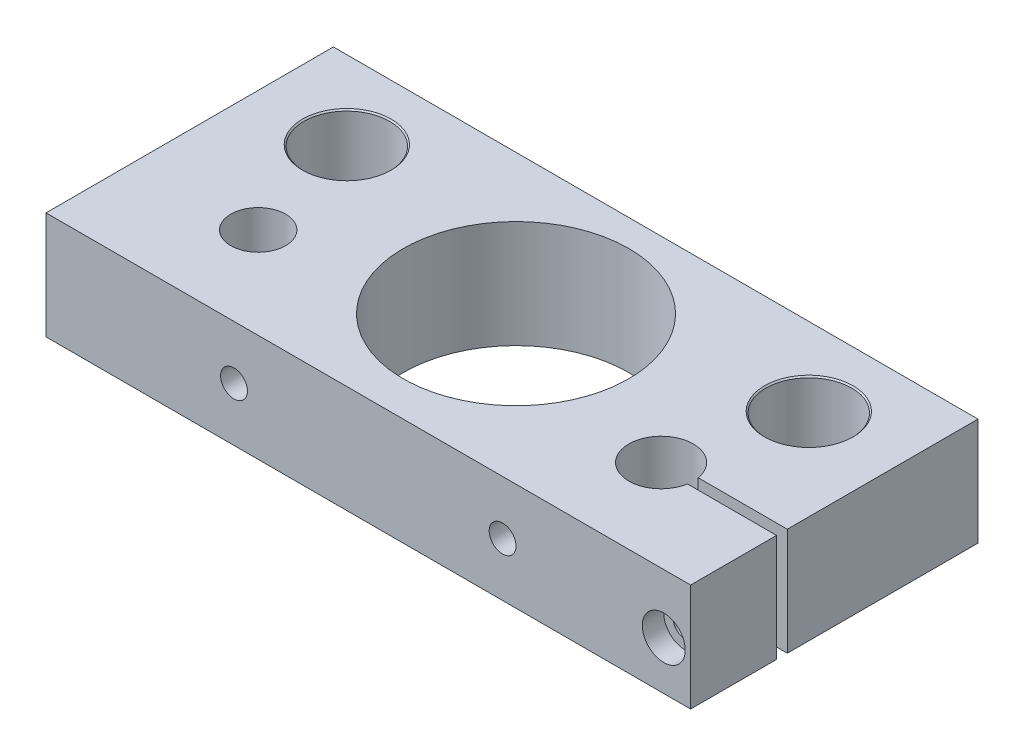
ISO-10303-21;
HEADER;
FILE_DESCRIPTION(('STEP AP214'),'2;1');
FILE_NAME('part.step','',(''),(''),'','','');
FILE_SCHEMA(('AUTOMOTIVE_DESIGN { 1 0 10303 214 1 1 1 1 }'));
ENDSEC;
DATA;
#1=APPLICATION_CONTEXT('core data for automotive mechanical design processes');
#2=APPLICATION_PROTOCOL_DEFINITION('international standard','automotive_design',2000,#1);
#3=PRODUCT_CONTEXT('',#1,'mechanical');
#4=PRODUCT('Part','Part','',(#3));
#5=PRODUCT_RELATED_PRODUCT_CATEGORY('part','',(#4));
#6=PRODUCT_DEFINITION_FORMATION('','',#4);
#7=PRODUCT_DEFINITION_CONTEXT('part definition',#1,'design');
#8=PRODUCT_DEFINITION('design','',#6,#7);
#9=PRODUCT_DEFINITION_SHAPE('','',#8);
#10=(LENGTH_UNIT() NAMED_UNIT(*) SI_UNIT(.MILLI.,.METRE.));
#11=(NAMED_UNIT(*) PLANE_ANGLE_UNIT() SI_UNIT($,.RADIAN.));
#12=(NAMED_UNIT(*) SI_UNIT($,.STERADIAN.) SOLID_ANGLE_UNIT());
#13=UNCERTAINTY_MEASURE_WITH_UNIT(LENGTH_MEASURE(1.E-05),#10,'distance_accuracy_value','');
#14=(GEOMETRIC_REPRESENTATION_CONTEXT(3) GLOBAL_UNCERTAINTY_ASSIGNED_CONTEXT((#13)) GLOBAL_UNIT_ASSIGNED_CONTEXT((#10,
#11,#12)) REPRESENTATION_CONTEXT('',''));
#15=CARTESIAN_POINT('',(0.,0.,0.));
#16=DIRECTION('',(0.,0.,1.));
#17=DIRECTION('',(1.,0.,0.));
#18=AXIS2_PLACEMENT_3D('',#15,#16,#17);
#19=CARTESIAN_POINT('',(120.,20.,0.));
#20=DIRECTION('',(-1.,0.,0.));
#21=DIRECTION('',(0.,0.,1.));
#22=AXIS2_PLACEMENT_3D('',#19,#20,#21);
#23=PLANE('',#22);
#24=DIRECTION('',(0.,0.,-1.));
#25=VECTOR('',#24,1.);
#26=CARTESIAN_POINT('',(120.,0.,0.));
#27=LINE('',#26,#25);
#28=CARTESIAN_POINT('',(120.,0.,0.));
#29=VERTEX_POINT('',#28);
#30=CARTESIAN_POINT('',(120.,0.,-16.));
#31=VERTEX_POINT('',#30);
#32=EDGE_CURVE('E9334',#29,#31,#27,.T.);
#33=ORIENTED_EDGE('',*,*,#32,.T.);
#34=DIRECTION('',(0.,-1.,0.));
#35=VECTOR('',#34,1.);
#36=CARTESIAN_POINT('',(120.,-0.999999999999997,-16.));
#37=LINE('',#36,#35);
#38=CARTESIAN_POINT('',(120.,20.,-16.));
#39=VERTEX_POINT('',#38);
#40=EDGE_CURVE('E9271',#39,#31,#37,.T.);
#41=ORIENTED_EDGE('',*,*,#40,.F.);
#42=DIRECTION('',(0.,0.,-1.));
#43=VECTOR('',#42,1.);
#44=CARTESIAN_POINT('',(120.,20.,0.));
#45=LINE('',#44,#43);
#46=CARTESIAN_POINT('',(120.,20.,0.));
#47=VERTEX_POINT('',#46);
#48=EDGE_CURVE('E9345',#47,#39,#45,.T.);
#49=ORIENTED_EDGE('',*,*,#48,.F.);
#50=DIRECTION('',(0.,-1.,0.));
#51=VECTOR('',#50,1.);
#52=CARTESIAN_POINT('',(120.,20.,0.));
#53=LINE('',#52,#51);
#54=EDGE_CURVE('E9356',#47,#29,#53,.T.);
#55=ORIENTED_EDGE('',*,*,#54,.T.);
#56=EDGE_LOOP('',(#33,#41,#49,#55));
#57=FACE_BOUND('',#56,.T.);
#58=ADVANCED_FACE('F9174',(#57),#23,.F.);
#59=CARTESIAN_POINT('',(0.,20.,0.));
#60=DIRECTION('',(1.,0.,0.));
#61=DIRECTION('',(0.,0.,-1.));
#62=AXIS2_PLACEMENT_3D('',#59,#60,#61);
#63=PLANE('',#62);
#64=DIRECTION('',(0.,0.,1.));
#65=VECTOR('',#64,1.);
#66=CARTESIAN_POINT('',(0.,0.,0.));
#67=LINE('',#66,#65);
#68=CARTESIAN_POINT('',(0.,0.,-53.5));
#69=VERTEX_POINT('',#68);
#70=CARTESIAN_POINT('',(0.,0.,0.));
#71=VERTEX_POINT('',#70);
#72=EDGE_CURVE('E9328',#69,#71,#67,.T.);
#73=ORIENTED_EDGE('',*,*,#72,.T.);
#74=DIRECTION('',(0.,-1.,0.));
#75=VECTOR('',#74,1.);
#76=CARTESIAN_POINT('',(0.,20.,0.));
#77=LINE('',#76,#75);
#78=CARTESIAN_POINT('',(0.,20.,0.));
#79=VERTEX_POINT('',#78);
#80=EDGE_CURVE('E9359',#79,#71,#77,.T.);
#81=ORIENTED_EDGE('',*,*,#80,.F.);
#82=DIRECTION('',(0.,0.,1.));
#83=VECTOR('',#82,1.);
#84=CARTESIAN_POINT('',(0.,20.,0.));
#85=LINE('',#84,#83);
#86=CARTESIAN_POINT('',(0.,20.,-53.5));
#87=VERTEX_POINT('',#86);
#88=EDGE_CURVE('E9339',#87,#79,#85,.T.);
#89=ORIENTED_EDGE('',*,*,#88,.F.);
#90=DIRECTION('',(0.,-1.,0.));
#91=VECTOR('',#90,1.);
#92=CARTESIAN_POINT('',(0.,20.,-53.5));
#93=LINE('',#92,#91);
#94=EDGE_CURVE('E9350',#87,#69,#93,.T.);
#95=ORIENTED_EDGE('',*,*,#94,.T.);
#96=EDGE_LOOP('',(#73,#81,#89,#95));
#97=FACE_BOUND('',#96,.T.);
#98=ADVANCED_FACE('F9176',(#97),#63,.F.);
#99=CARTESIAN_POINT('',(0.,20.,0.));
#100=DIRECTION('',(0.,0.,-1.));
#101=DIRECTION('',(-1.,0.,0.));
#102=AXIS2_PLACEMENT_3D('',#99,#100,#101);
#103=PLANE('',#102);
#104=CARTESIAN_POINT('',(115.,9.,0.));
#105=DIRECTION('',(0.,0.,1.));
#106=DIRECTION('',(1.,0.,0.));
#107=AXIS2_PLACEMENT_3D('',#104,#105,#106);
#108=CIRCLE('',#107,4.);
#109=CARTESIAN_POINT('',(119.,9.,0.));
#110=VERTEX_POINT('',#109);
#111=EDGE_CURVE('E9266',#110,#110,#108,.T.);
#112=ORIENTED_EDGE('',*,*,#111,.F.);
#113=EDGE_LOOP('',(#112));
#114=FACE_BOUND('',#113,.T.);
#115=CARTESIAN_POINT('',(85.,10.,0.));
#116=DIRECTION('',(0.,0.,1.));
#117=DIRECTION('',(1.,0.,0.));
#118=AXIS2_PLACEMENT_3D('',#115,#116,#117);
#119=CIRCLE('',#118,2.49999999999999);
#120=CARTESIAN_POINT('',(87.5,10.,0.));
#121=VERTEX_POINT('',#120);
#122=EDGE_CURVE('E9295',#121,#121,#119,.T.);
#123=ORIENTED_EDGE('',*,*,#122,.F.);
#124=EDGE_LOOP('',(#123));
#125=FACE_BOUND('',#124,.T.);
#126=CARTESIAN_POINT('',(35.,10.,0.));
#127=DIRECTION('',(0.,0.,1.));
#128=DIRECTION('',(1.,0.,0.));
#129=AXIS2_PLACEMENT_3D('',#126,#127,#128);
#130=CIRCLE('',#129,2.49999999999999);
#131=CARTESIAN_POINT('',(37.5,10.,0.));
#132=VERTEX_POINT('',#131);
#133=EDGE_CURVE('E9301',#132,#132,#130,.T.);
#134=ORIENTED_EDGE('',*,*,#133,.F.);
#135=EDGE_LOOP('',(#134));
#136=FACE_BOUND('',#135,.T.);
#137=DIRECTION('',(1.,0.,0.));
#138=VECTOR('',#137,1.);
#139=CARTESIAN_POINT('',(0.,0.,0.));
#140=LINE('',#139,#138);
#141=EDGE_CURVE('E9331',#71,#29,#140,.T.);
#142=ORIENTED_EDGE('',*,*,#141,.T.);
#143=ORIENTED_EDGE('',*,*,#54,.F.);
#144=DIRECTION('',(1.,0.,0.));
#145=VECTOR('',#144,1.);
#146=CARTESIAN_POINT('',(0.,20.,0.));
#147=LINE('',#146,#145);
#148=EDGE_CURVE('E9342',#79,#47,#147,.T.);
#149=ORIENTED_EDGE('',*,*,#148,.F.);
#150=ORIENTED_EDGE('',*,*,#80,.T.);
#151=EDGE_LOOP('',(#142,#143,#149,#150));
#152=FACE_BOUND('',#151,.T.);
#153=ADVANCED_FACE('F9396',(#114,#125,#136,#152),#103,.F.);
#154=CARTESIAN_POINT('',(120.,20.,-18.));
#155=VERTEX_POINT('',#154);
#156=CARTESIAN_POINT('',(120.,20.,-53.5));
#157=VERTEX_POINT('',#156);
#158=EDGE_CURVE('E9344',#155,#157,#45,.T.);
#159=ORIENTED_EDGE('',*,*,#158,.F.);
#160=DIRECTION('',(0.,1.,0.));
#161=VECTOR('',#160,1.);
#162=CARTESIAN_POINT('',(120.,-0.999999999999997,-18.));
#163=LINE('',#162,#161);
#164=CARTESIAN_POINT('',(120.,0.,-18.));
#165=VERTEX_POINT('',#164);
#166=EDGE_CURVE('E9269',#165,#155,#163,.T.);
#167=ORIENTED_EDGE('',*,*,#166,.F.);
#168=CARTESIAN_POINT('',(120.,0.,-53.5));
#169=VERTEX_POINT('',#168);
#170=EDGE_CURVE('E9333',#165,#169,#27,.T.);
#171=ORIENTED_EDGE('',*,*,#170,.T.);
#172=DIRECTION('',(0.,-1.,0.));
#173=VECTOR('',#172,1.);
#174=CARTESIAN_POINT('',(120.,20.,-53.5));
#175=LINE('',#174,#173);
#176=EDGE_CURVE('E9353',#157,#169,#175,.T.);
#177=ORIENTED_EDGE('',*,*,#176,.F.);
#178=EDGE_LOOP('',(#159,#167,#171,#177));
#179=FACE_BOUND('',#178,.T.);
#180=ADVANCED_FACE('F9386',(#179),#23,.F.);
#181=CARTESIAN_POINT('',(0.,20.,-53.5));
#182=DIRECTION('',(0.,0.,1.));
#183=DIRECTION('',(1.,0.,0.));
#184=AXIS2_PLACEMENT_3D('',#181,#182,#183);
#185=PLANE('',#184);
#186=CARTESIAN_POINT('',(85.,10.,-53.5));
#187=DIRECTION('',(0.,0.,1.));
#188=DIRECTION('',(1.,0.,0.));
#189=AXIS2_PLACEMENT_3D('',#186,#187,#188);
#190=CIRCLE('',#189,2.49999999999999);
#191=CARTESIAN_POINT('',(87.5,10.,-53.5));
#192=VERTEX_POINT('',#191);
#193=EDGE_CURVE('E9292',#192,#192,#190,.T.);
#194=ORIENTED_EDGE('',*,*,#193,.T.);
#195=EDGE_LOOP('',(#194));
#196=FACE_BOUND('',#195,.T.);
#197=CARTESIAN_POINT('',(35.,10.,-53.5));
#198=DIRECTION('',(0.,0.,1.));
#199=DIRECTION('',(1.,0.,0.));
#200=AXIS2_PLACEMENT_3D('',#197,#198,#199);
#201=CIRCLE('',#200,2.49999999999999);
#202=CARTESIAN_POINT('',(37.5,10.,-53.5));
#203=VERTEX_POINT('',#202);
#204=EDGE_CURVE('E9298',#203,#203,#201,.T.);
#205=ORIENTED_EDGE('',*,*,#204,.T.);
#206=EDGE_LOOP('',(#205));
#207=FACE_BOUND('',#206,.T.);
#208=DIRECTION('',(-1.,0.,0.));
#209=VECTOR('',#208,1.);
#210=CARTESIAN_POINT('',(0.,0.,-53.5));
#211=LINE('',#210,#209);
#212=EDGE_CURVE('E9337',#169,#69,#211,.T.);
#213=ORIENTED_EDGE('',*,*,#212,.T.);
#214=ORIENTED_EDGE('',*,*,#94,.F.);
#215=DIRECTION('',(-1.,0.,0.));
#216=VECTOR('',#215,1.);
#217=CARTESIAN_POINT('',(0.,20.,-53.5));
#218=LINE('',#217,#216);
#219=EDGE_CURVE('E9348',#157,#87,#218,.T.);
#220=ORIENTED_EDGE('',*,*,#219,.F.);
#221=ORIENTED_EDGE('',*,*,#176,.T.);
#222=EDGE_LOOP('',(#213,#214,#220,#221));
#223=FACE_BOUND('',#222,.T.);
#224=ADVANCED_FACE('F9393',(#196,#207,#223),#185,.F.);
#225=CARTESIAN_POINT('',(0.,20.,-53.5));
#226=DIRECTION('',(0.,-1.,0.));
#227=DIRECTION('',(0.,0.,-1.));
#228=AXIS2_PLACEMENT_3D('',#225,#226,#227);
#229=PLANE('',#228);
#230=CARTESIAN_POINT('',(60.,20.,-27.5));
#231=DIRECTION('',(0.,-1.,0.));
#232=DIRECTION('',(0.,0.,-1.));
#233=AXIS2_PLACEMENT_3D('',#230,#231,#232);
#234=CIRCLE('',#233,21.);
#235=CARTESIAN_POINT('',(60.,20.,-48.5));
#236=VERTEX_POINT('',#235);
#237=EDGE_CURVE('E9251',#236,#236,#234,.T.);
#238=ORIENTED_EDGE('',*,*,#237,.T.);
#239=EDGE_LOOP('',(#238));
#240=FACE_BOUND('',#239,.T.);
#241=CARTESIAN_POINT('',(22.5,20.,-17.));
#242=DIRECTION('',(0.,-1.,0.));
#243=DIRECTION('',(0.,0.,-1.));
#244=AXIS2_PLACEMENT_3D('',#241,#242,#243);
#245=CIRCLE('',#244,5.1);
#246=CARTESIAN_POINT('',(22.5,20.,-22.1));
#247=VERTEX_POINT('',#246);
#248=EDGE_CURVE('E9280',#247,#247,#245,.T.);
#249=ORIENTED_EDGE('',*,*,#248,.T.);
#250=EDGE_LOOP('',(#249));
#251=FACE_BOUND('',#250,.T.);
#252=ORIENTED_EDGE('',*,*,#48,.T.);
#253=DIRECTION('',(-1.,0.,0.));
#254=VECTOR('',#253,1.);
#255=CARTESIAN_POINT('',(0.,20.,-16.));
#256=LINE('',#255,#254);
#257=CARTESIAN_POINT('',(103.4160797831,20.,-16.));
#258=VERTEX_POINT('',#257);
#259=EDGE_CURVE('E9277',#39,#258,#256,.T.);
#260=ORIENTED_EDGE('',*,*,#259,.T.);
#261=CARTESIAN_POINT('',(97.5,20.,-17.));
#262=DIRECTION('',(0.,-1.,0.));
#263=DIRECTION('',(0.,0.,-1.));
#264=AXIS2_PLACEMENT_3D('',#261,#262,#263);
#265=CIRCLE('',#264,5.99999999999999);
#266=CARTESIAN_POINT('',(103.4160797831,20.,-18.));
#267=VERTEX_POINT('',#266);
#268=EDGE_CURVE('E9286',#258,#267,#265,.T.);
#269=ORIENTED_EDGE('',*,*,#268,.T.);
#270=DIRECTION('',(1.,0.,0.));
#271=VECTOR('',#270,1.);
#272=CARTESIAN_POINT('',(0.,20.,-18.));
#273=LINE('',#272,#271);
#274=EDGE_CURVE('E9197',#267,#155,#273,.T.);
#275=ORIENTED_EDGE('',*,*,#274,.T.);
#276=ORIENTED_EDGE('',*,*,#158,.T.);
#277=ORIENTED_EDGE('',*,*,#219,.T.);
#278=ORIENTED_EDGE('',*,*,#88,.T.);
#279=ORIENTED_EDGE('',*,*,#148,.T.);
#280=EDGE_LOOP('',(#252,#260,#269,#275,#276,#277,#278,#279));
#281=FACE_BOUND('',#280,.T.);
#282=CARTESIAN_POINT('',(103.,20.,-39.));
#283=DIRECTION('',(0.,-1.,0.));
#284=DIRECTION('',(0.,0.,-1.));
#285=AXIS2_PLACEMENT_3D('',#282,#283,#284);
#286=CIRCLE('',#285,8.24999999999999);
#287=CARTESIAN_POINT('',(103.,20.,-47.25));
#288=VERTEX_POINT('',#287);
#289=EDGE_CURVE('E9304',#288,#288,#286,.T.);
#290=ORIENTED_EDGE('',*,*,#289,.T.);
#291=EDGE_LOOP('',(#290));
#292=FACE_BOUND('',#291,.T.);
#293=CARTESIAN_POINT('',(17.,20.,-39.));
#294=DIRECTION('',(0.,-1.,0.));
#295=DIRECTION('',(0.,0.,-1.));
#296=AXIS2_PLACEMENT_3D('',#293,#294,#295);
#297=CIRCLE('',#296,8.24999999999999);
#298=CARTESIAN_POINT('',(17.,20.,-47.25));
#299=VERTEX_POINT('',#298);
#300=EDGE_CURVE('E9316',#299,#299,#297,.T.);
#301=ORIENTED_EDGE('',*,*,#300,.T.);
#302=EDGE_LOOP('',(#301));
#303=FACE_BOUND('',#302,.T.);
#304=ADVANCED_FACE('F9368',(#240,#251,#281,#292,#303),#229,.F.);
#305=CARTESIAN_POINT('',(0.,0.,-53.5));
#306=DIRECTION('',(0.,-1.,0.));
#307=DIRECTION('',(0.,0.,-1.));
#308=AXIS2_PLACEMENT_3D('',#305,#306,#307);
#309=PLANE('',#308);
#310=CARTESIAN_POINT('',(60.,0.,-27.5));
#311=DIRECTION('',(0.,-1.,0.));
#312=DIRECTION('',(0.,0.,-1.));
#313=AXIS2_PLACEMENT_3D('',#310,#311,#312);
#314=CIRCLE('',#313,21.);
#315=CARTESIAN_POINT('',(60.,0.,-48.5));
#316=VERTEX_POINT('',#315);
#317=EDGE_CURVE('E9257',#316,#316,#314,.T.);
#318=ORIENTED_EDGE('',*,*,#317,.F.);
#319=EDGE_LOOP('',(#318));
#320=FACE_BOUND('',#319,.T.);
#321=DIRECTION('',(-1.,0.,0.));
#322=VECTOR('',#321,1.);
#323=CARTESIAN_POINT('',(0.,0.,-16.));
#324=LINE('',#323,#322);
#325=CARTESIAN_POINT('',(103.4160797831,0.,-16.));
#326=VERTEX_POINT('',#325);
#327=EDGE_CURVE('E9190',#31,#326,#324,.T.);
#328=ORIENTED_EDGE('',*,*,#327,.F.);
#329=ORIENTED_EDGE('',*,*,#32,.F.);
#330=ORIENTED_EDGE('',*,*,#141,.F.);
#331=ORIENTED_EDGE('',*,*,#72,.F.);
#332=ORIENTED_EDGE('',*,*,#212,.F.);
#333=ORIENTED_EDGE('',*,*,#170,.F.);
#334=DIRECTION('',(1.,0.,0.));
#335=VECTOR('',#334,1.);
#336=CARTESIAN_POINT('',(0.,0.,-18.));
#337=LINE('',#336,#335);
#338=CARTESIAN_POINT('',(103.4160797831,0.,-18.));
#339=VERTEX_POINT('',#338);
#340=EDGE_CURVE('E9273',#339,#165,#337,.T.);
#341=ORIENTED_EDGE('',*,*,#340,.F.);
#342=CARTESIAN_POINT('',(97.5,0.,-17.));
#343=DIRECTION('',(0.,-1.,0.));
#344=DIRECTION('',(0.,0.,-1.));
#345=AXIS2_PLACEMENT_3D('',#342,#343,#344);
#346=CIRCLE('',#345,5.99999999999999);
#347=EDGE_CURVE('E9289',#326,#339,#346,.T.);
#348=ORIENTED_EDGE('',*,*,#347,.F.);
#349=EDGE_LOOP('',(#328,#329,#330,#331,#332,#333,#341,#348));
#350=FACE_BOUND('',#349,.T.);
#351=CARTESIAN_POINT('',(22.5,0.,-17.));
#352=DIRECTION('',(0.,-1.,0.));
#353=DIRECTION('',(0.,0.,-1.));
#354=AXIS2_PLACEMENT_3D('',#351,#352,#353);
#355=CIRCLE('',#354,5.09999999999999);
#356=CARTESIAN_POINT('',(22.5,0.,-22.1));
#357=VERTEX_POINT('',#356);
#358=EDGE_CURVE('E9283',#357,#357,#355,.T.);
#359=ORIENTED_EDGE('',*,*,#358,.F.);
#360=EDGE_LOOP('',(#359));
#361=FACE_BOUND('',#360,.T.);
#362=CARTESIAN_POINT('',(103.,0.,-39.));
#363=DIRECTION('',(0.,-1.,0.));
#364=DIRECTION('',(0.,0.,-1.));
#365=AXIS2_PLACEMENT_3D('',#362,#363,#364);
#366=CIRCLE('',#365,8.25000000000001);
#367=CARTESIAN_POINT('',(103.,0.,-47.25));
#368=VERTEX_POINT('',#367);
#369=EDGE_CURVE('E9313',#368,#368,#366,.T.);
#370=ORIENTED_EDGE('',*,*,#369,.F.);
#371=EDGE_LOOP('',(#370));
#372=FACE_BOUND('',#371,.T.);
#373=CARTESIAN_POINT('',(17.,0.,-39.));
#374=DIRECTION('',(0.,-1.,0.));
#375=DIRECTION('',(0.,0.,-1.));
#376=AXIS2_PLACEMENT_3D('',#373,#374,#375);
#377=CIRCLE('',#376,8.25);
#378=CARTESIAN_POINT('',(17.,0.,-47.25));
#379=VERTEX_POINT('',#378);
#380=EDGE_CURVE('E9325',#379,#379,#377,.T.);
#381=ORIENTED_EDGE('',*,*,#380,.F.);
#382=EDGE_LOOP('',(#381));
#383=FACE_BOUND('',#382,.T.);
#384=ADVANCED_FACE('F9378',(#320,#350,#361,#372,#383),#309,.T.);
#385=CARTESIAN_POINT('',(17.,0.,-39.));
#386=DIRECTION('',(0.,-1.,0.));
#387=DIRECTION('',(0.,0.,-1.));
#388=AXIS2_PLACEMENT_3D('',#385,#386,#387);
#389=CONICAL_SURFACE('',#388,8.25,0.785398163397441);
#390=CARTESIAN_POINT('',(17.,0.250000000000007,-39.));
#391=DIRECTION('',(0.,-1.,0.));
#392=DIRECTION('',(0.,0.,-1.));
#393=AXIS2_PLACEMENT_3D('',#390,#391,#392);
#394=CIRCLE('',#393,8.);
#395=CARTESIAN_POINT('',(17.,0.250000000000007,-47.));
#396=VERTEX_POINT('',#395);
#397=EDGE_CURVE('E9322',#396,#396,#394,.T.);
#398=ORIENTED_EDGE('',*,*,#397,.F.);
#399=EDGE_LOOP('',(#398));
#400=FACE_BOUND('',#399,.T.);
#401=ORIENTED_EDGE('',*,*,#380,.T.);
#402=EDGE_LOOP('',(#401));
#403=FACE_BOUND('',#402,.T.);
#404=ADVANCED_FACE('F9421',(#400,#403),#389,.F.);
#405=CARTESIAN_POINT('',(17.,0.,-39.));
#406=DIRECTION('',(0.,-1.,0.));
#407=DIRECTION('',(0.,0.,-1.));
#408=AXIS2_PLACEMENT_3D('',#405,#406,#407);
#409=CYLINDRICAL_SURFACE('',#408,7.99999999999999);
#410=CARTESIAN_POINT('',(17.,19.75,-39.));
#411=DIRECTION('',(0.,-1.,0.));
#412=DIRECTION('',(0.,0.,-1.));
#413=AXIS2_PLACEMENT_3D('',#410,#411,#412);
#414=CIRCLE('',#413,7.99999999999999);
#415=CARTESIAN_POINT('',(17.,19.75,-47.));
#416=VERTEX_POINT('',#415);
#417=EDGE_CURVE('E9319',#416,#416,#414,.T.);
#418=ORIENTED_EDGE('',*,*,#417,.F.);
#419=EDGE_LOOP('',(#418));
#420=FACE_BOUND('',#419,.T.);
#421=ORIENTED_EDGE('',*,*,#397,.T.);
#422=EDGE_LOOP('',(#421));
#423=FACE_BOUND('',#422,.T.);
#424=ADVANCED_FACE('F9425',(#420,#423),#409,.F.);
#425=CARTESIAN_POINT('',(17.,19.75,-39.));
#426=DIRECTION('',(0.,1.,0.));
#427=DIRECTION('',(0.,0.,1.));
#428=AXIS2_PLACEMENT_3D('',#425,#426,#427);
#429=CONICAL_SURFACE('',#428,7.99999999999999,0.785398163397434);
#430=ORIENTED_EDGE('',*,*,#300,.F.);
#431=EDGE_LOOP('',(#430));
#432=FACE_BOUND('',#431,.T.);
#433=ORIENTED_EDGE('',*,*,#417,.T.);
#434=EDGE_LOOP('',(#433));
#435=FACE_BOUND('',#434,.T.);
#436=ADVANCED_FACE('F9429',(#432,#435),#429,.F.);
#437=CARTESIAN_POINT('',(103.,0.,-39.));
#438=DIRECTION('',(0.,-1.,0.));
#439=DIRECTION('',(0.,0.,-1.));
#440=AXIS2_PLACEMENT_3D('',#437,#438,#439);
#441=CONICAL_SURFACE('',#440,8.25000000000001,0.785398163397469);
#442=CARTESIAN_POINT('',(103.,0.250000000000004,-39.));
#443=DIRECTION('',(0.,-1.,0.));
#444=DIRECTION('',(0.,0.,-1.));
#445=AXIS2_PLACEMENT_3D('',#442,#443,#444);
#446=CIRCLE('',#445,7.99999999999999);
#447=CARTESIAN_POINT('',(103.,0.250000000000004,-47.));
#448=VERTEX_POINT('',#447);
#449=EDGE_CURVE('E9310',#448,#448,#446,.T.);
#450=ORIENTED_EDGE('',*,*,#449,.F.);
#451=EDGE_LOOP('',(#450));
#452=FACE_BOUND('',#451,.T.);
#453=ORIENTED_EDGE('',*,*,#369,.T.);
#454=EDGE_LOOP('',(#453));
#455=FACE_BOUND('',#454,.T.);
#456=ADVANCED_FACE('F9433',(#452,#455),#441,.F.);
#457=CARTESIAN_POINT('',(103.,0.,-39.));
#458=DIRECTION('',(0.,-1.,0.));
#459=DIRECTION('',(0.,0.,-1.));
#460=AXIS2_PLACEMENT_3D('',#457,#458,#459);
#461=CYLINDRICAL_SURFACE('',#460,7.99999999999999);
#462=CARTESIAN_POINT('',(103.,19.75,-39.));
#463=DIRECTION('',(0.,-1.,0.));
#464=DIRECTION('',(0.,0.,-1.));
#465=AXIS2_PLACEMENT_3D('',#462,#463,#464);
#466=CIRCLE('',#465,7.99999999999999);
#467=CARTESIAN_POINT('',(103.,19.75,-47.));
#468=VERTEX_POINT('',#467);
#469=EDGE_CURVE('E9307',#468,#468,#466,.T.);
#470=ORIENTED_EDGE('',*,*,#469,.F.);
#471=EDGE_LOOP('',(#470));
#472=FACE_BOUND('',#471,.T.);
#473=ORIENTED_EDGE('',*,*,#449,.T.);
#474=EDGE_LOOP('',(#473));
#475=FACE_BOUND('',#474,.T.);
#476=ADVANCED_FACE('F9437',(#472,#475),#461,.F.);
#477=CARTESIAN_POINT('',(103.,19.75,-39.));
#478=DIRECTION('',(0.,1.,0.));
#479=DIRECTION('',(0.,0.,1.));
#480=AXIS2_PLACEMENT_3D('',#477,#478,#479);
#481=CONICAL_SURFACE('',#480,7.99999999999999,0.785398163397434);
#482=ORIENTED_EDGE('',*,*,#289,.F.);
#483=EDGE_LOOP('',(#482));
#484=FACE_BOUND('',#483,.T.);
#485=ORIENTED_EDGE('',*,*,#469,.T.);
#486=EDGE_LOOP('',(#485));
#487=FACE_BOUND('',#486,.T.);
#488=ADVANCED_FACE('F9441',(#484,#487),#481,.F.);
#489=CARTESIAN_POINT('',(35.,10.,0.));
#490=DIRECTION('',(0.,0.,1.));
#491=DIRECTION('',(1.,0.,0.));
#492=AXIS2_PLACEMENT_3D('',#489,#490,#491);
#493=CYLINDRICAL_SURFACE('',#492,2.49999999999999);
#494=ORIENTED_EDGE('',*,*,#204,.F.);
#495=EDGE_LOOP('',(#494));
#496=FACE_BOUND('',#495,.T.);
#497=ORIENTED_EDGE('',*,*,#133,.T.);
#498=EDGE_LOOP('',(#497));
#499=FACE_BOUND('',#498,.T.);
#500=ADVANCED_FACE('F9445',(#496,#499),#493,.F.);
#501=CARTESIAN_POINT('',(85.,10.,0.));
#502=DIRECTION('',(0.,0.,1.));
#503=DIRECTION('',(1.,0.,0.));
#504=AXIS2_PLACEMENT_3D('',#501,#502,#503);
#505=CYLINDRICAL_SURFACE('',#504,2.49999999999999);
#506=ORIENTED_EDGE('',*,*,#193,.F.);
#507=EDGE_LOOP('',(#506));
#508=FACE_BOUND('',#507,.T.);
#509=ORIENTED_EDGE('',*,*,#122,.T.);
#510=EDGE_LOOP('',(#509));
#511=FACE_BOUND('',#510,.T.);
#512=ADVANCED_FACE('F9449',(#508,#511),#505,.F.);
#513=CARTESIAN_POINT('',(97.5,0.,-17.));
#514=DIRECTION('',(0.,-1.,0.));
#515=DIRECTION('',(0.,0.,-1.));
#516=AXIS2_PLACEMENT_3D('',#513,#514,#515);
#517=CYLINDRICAL_SURFACE('',#516,5.99999999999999);
#518=ORIENTED_EDGE('',*,*,#268,.F.);
#519=DIRECTION('',(0.,-1.,0.));
#520=VECTOR('',#519,1.);
#521=CARTESIAN_POINT('',(103.4160797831,0.,-16.));
#522=LINE('',#521,#520);
#523=EDGE_CURVE('E11',#258,#326,#522,.T.);
#524=ORIENTED_EDGE('',*,*,#523,.T.);
#525=ORIENTED_EDGE('',*,*,#347,.T.);
#526=DIRECTION('',(0.,-1.,0.));
#527=VECTOR('',#526,1.);
#528=CARTESIAN_POINT('',(103.4160797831,0.,-18.));
#529=LINE('',#528,#527);
#530=EDGE_CURVE('E9183',#339,#267,#529,.F.);
#531=ORIENTED_EDGE('',*,*,#530,.T.);
#532=EDGE_LOOP('',(#518,#524,#525,#531));
#533=FACE_BOUND('',#532,.T.);
#534=ADVANCED_FACE('F9364',(#533),#517,.F.);
#535=CARTESIAN_POINT('',(22.5,0.,-17.));
#536=DIRECTION('',(0.,-1.,0.));
#537=DIRECTION('',(0.,0.,-1.));
#538=AXIS2_PLACEMENT_3D('',#535,#536,#537);
#539=CYLINDRICAL_SURFACE('',#538,5.09999999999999);
#540=ORIENTED_EDGE('',*,*,#248,.F.);
#541=EDGE_LOOP('',(#540));
#542=FACE_BOUND('',#541,.T.);
#543=ORIENTED_EDGE('',*,*,#358,.T.);
#544=EDGE_LOOP('',(#543));
#545=FACE_BOUND('',#544,.T.);
#546=ADVANCED_FACE('F9455',(#542,#545),#539,.F.);
#547=CARTESIAN_POINT('',(97.5,-0.999999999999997,-18.));
#548=DIRECTION('',(0.,0.,-1.));
#549=DIRECTION('',(0.,1.,0.));
#550=AXIS2_PLACEMENT_3D('',#547,#548,#549);
#551=PLANE('',#550);
#552=CARTESIAN_POINT('',(115.,9.,-18.));
#553=DIRECTION('',(0.,0.,1.));
#554=DIRECTION('',(1.,0.,0.));
#555=AXIS2_PLACEMENT_3D('',#552,#553,#554);
#556=CIRCLE('',#555,1.64999999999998);
#557=CARTESIAN_POINT('',(116.65,9.,-18.));
#558=VERTEX_POINT('',#557);
#559=EDGE_CURVE('E9250',#558,#558,#556,.T.);
#560=ORIENTED_EDGE('',*,*,#559,.F.);
#561=EDGE_LOOP('',(#560));
#562=FACE_BOUND('',#561,.T.);
#563=ORIENTED_EDGE('',*,*,#530,.F.);
#564=ORIENTED_EDGE('',*,*,#340,.T.);
#565=ORIENTED_EDGE('',*,*,#166,.T.);
#566=ORIENTED_EDGE('',*,*,#274,.F.);
#567=EDGE_LOOP('',(#563,#564,#565,#566));
#568=FACE_BOUND('',#567,.T.);
#569=ADVANCED_FACE('F9384',(#562,#568),#551,.F.);
#570=CARTESIAN_POINT('',(97.5,-0.999999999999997,-16.));
#571=DIRECTION('',(0.,0.,1.));
#572=DIRECTION('',(0.,-1.,0.));
#573=AXIS2_PLACEMENT_3D('',#570,#571,#572);
#574=PLANE('',#573);
#575=CARTESIAN_POINT('',(115.,9.,-16.));
#576=DIRECTION('',(0.,0.,1.));
#577=DIRECTION('',(0.,-1.,0.));
#578=AXIS2_PLACEMENT_3D('',#575,#576,#577);
#579=CIRCLE('',#578,2.25);
#580=CARTESIAN_POINT('',(115.,6.75,-16.));
#581=VERTEX_POINT('',#580);
#582=EDGE_CURVE('E9178',#581,#581,#579,.T.);
#583=ORIENTED_EDGE('',*,*,#582,.T.);
#584=EDGE_LOOP('',(#583));
#585=FACE_BOUND('',#584,.T.);
#586=ORIENTED_EDGE('',*,*,#40,.T.);
#587=ORIENTED_EDGE('',*,*,#327,.T.);
#588=ORIENTED_EDGE('',*,*,#523,.F.);
#589=ORIENTED_EDGE('',*,*,#259,.F.);
#590=EDGE_LOOP('',(#586,#587,#588,#589));
#591=FACE_BOUND('',#590,.T.);
#592=ADVANCED_FACE('F9373',(#585,#591),#574,.F.);
#593=CARTESIAN_POINT('',(115.,9.,0.));
#594=DIRECTION('',(0.,0.,1.));
#595=DIRECTION('',(1.,0.,0.));
#596=AXIS2_PLACEMENT_3D('',#593,#594,#595);
#597=CYLINDRICAL_SURFACE('',#596,2.25);
#598=CARTESIAN_POINT('',(115.,9.,-4.));
#599=DIRECTION('',(0.,0.,1.));
#600=DIRECTION('',(1.,0.,0.));
#601=AXIS2_PLACEMENT_3D('',#598,#599,#600);
#602=CIRCLE('',#601,2.25);
#603=CARTESIAN_POINT('',(117.25,9.,-4.));
#604=VERTEX_POINT('',#603);
#605=EDGE_CURVE('E9254',#604,#604,#602,.T.);
#606=ORIENTED_EDGE('',*,*,#605,.T.);
#607=EDGE_LOOP('',(#606));
#608=FACE_BOUND('',#607,.T.);
#609=ORIENTED_EDGE('',*,*,#582,.F.);
#610=EDGE_LOOP('',(#609));
#611=FACE_BOUND('',#610,.T.);
#612=ADVANCED_FACE('F9462',(#608,#611),#597,.F.);
#613=CARTESIAN_POINT('',(115.,9.,0.));
#614=DIRECTION('',(0.,0.,1.));
#615=DIRECTION('',(1.,0.,0.));
#616=AXIS2_PLACEMENT_3D('',#613,#614,#615);
#617=CYLINDRICAL_SURFACE('',#616,4.);
#618=CARTESIAN_POINT('',(115.,9.,-4.));
#619=DIRECTION('',(0.,0.,1.));
#620=DIRECTION('',(1.,0.,0.));
#621=AXIS2_PLACEMENT_3D('',#618,#619,#620);
#622=CIRCLE('',#621,4.);
#623=CARTESIAN_POINT('',(119.,9.,-4.));
#624=VERTEX_POINT('',#623);
#625=EDGE_CURVE('E9263',#624,#624,#622,.T.);
#626=ORIENTED_EDGE('',*,*,#625,.F.);
#627=EDGE_LOOP('',(#626));
#628=FACE_BOUND('',#627,.T.);
#629=ORIENTED_EDGE('',*,*,#111,.T.);
#630=EDGE_LOOP('',(#629));
#631=FACE_BOUND('',#630,.T.);
#632=ADVANCED_FACE('F9464',(#628,#631),#617,.F.);
#633=CARTESIAN_POINT('',(117.25,9.,-4.));
#634=DIRECTION('',(0.,0.,-1.));
#635=DIRECTION('',(-1.,0.,0.));
#636=AXIS2_PLACEMENT_3D('',#633,#634,#635);
#637=PLANE('',#636);
#638=ORIENTED_EDGE('',*,*,#605,.F.);
#639=EDGE_LOOP('',(#638));
#640=FACE_BOUND('',#639,.T.);
#641=ORIENTED_EDGE('',*,*,#625,.T.);
#642=EDGE_LOOP('',(#641));
#643=FACE_BOUND('',#642,.T.);
#644=ADVANCED_FACE('F9467',(#640,#643),#637,.F.);
#645=CARTESIAN_POINT('',(115.,9.,-18.));
#646=DIRECTION('',(0.,0.,1.));
#647=DIRECTION('',(1.,0.,0.));
#648=AXIS2_PLACEMENT_3D('',#645,#646,#647);
#649=CYLINDRICAL_SURFACE('',#648,1.64999999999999);
#650=CARTESIAN_POINT('',(115.,9.,-28.1));
#651=DIRECTION('',(0.,0.,1.));
#652=DIRECTION('',(1.,0.,0.));
#653=AXIS2_PLACEMENT_3D('',#650,#651,#652);
#654=CIRCLE('',#653,1.65);
#655=CARTESIAN_POINT('',(116.65,9.,-28.1));
#656=VERTEX_POINT('',#655);
#657=EDGE_CURVE('E9248',#656,#656,#654,.T.);
#658=ORIENTED_EDGE('',*,*,#657,.F.);
#659=EDGE_LOOP('',(#658));
#660=FACE_BOUND('',#659,.T.);
#661=ORIENTED_EDGE('',*,*,#559,.T.);
#662=EDGE_LOOP('',(#661));
#663=FACE_BOUND('',#662,.T.);
#664=ADVANCED_FACE('F9244',(#660,#663),#649,.F.);
#665=CARTESIAN_POINT('',(115.,9.,-28.1));
#666=DIRECTION('',(0.,0.,1.));
#667=DIRECTION('',(1.,0.,0.));
#668=AXIS2_PLACEMENT_3D('',#665,#666,#667);
#669=CONICAL_SURFACE('',#668,1.65,1.02974425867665);
#670=CARTESIAN_POINT('',(115.,9.,-29.0914200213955));
#671=VERTEX_POINT('',#670);
#672=VERTEX_LOOP('',#671);
#673=FACE_BOUND('',#672,.T.);
#674=ORIENTED_EDGE('',*,*,#657,.T.);
#675=EDGE_LOOP('',(#674));
#676=FACE_BOUND('',#675,.T.);
#677=ADVANCED_FACE('F9240',(#673,#676),#669,.F.);
#678=CARTESIAN_POINT('',(60.,25.,-27.5));
#679=DIRECTION('',(0.,-1.,0.));
#680=DIRECTION('',(0.,0.,-1.));
#681=AXIS2_PLACEMENT_3D('',#678,#679,#680);
#682=CYLINDRICAL_SURFACE('',#681,21.);
#683=ORIENTED_EDGE('',*,*,#317,.T.);
#684=EDGE_LOOP('',(#683));
#685=FACE_BOUND('',#684,.T.);
#686=ORIENTED_EDGE('',*,*,#237,.F.);
#687=EDGE_LOOP('',(#686));
#688=FACE_BOUND('',#687,.T.);
#689=ADVANCED_FACE('F9243',(#685,#688),#682,.F.);
#690=CLOSED_SHELL('',(#58,#98,#153,#180,#224,#304,#384,#404,#424,#436,#456,#476,#488,#500,#512,
#534,#546,#569,#592,#612,#632,#644,#664,#677,#689));
#691=MANIFOLD_SOLID_BREP('B2',#690);
#692=ADVANCED_BREP_SHAPE_REPRESENTATION('',(#18,#691),#14);
#693=SHAPE_DEFINITION_REPRESENTATION(#9,#692);
ENDSEC;
END-ISO-10303-21;
